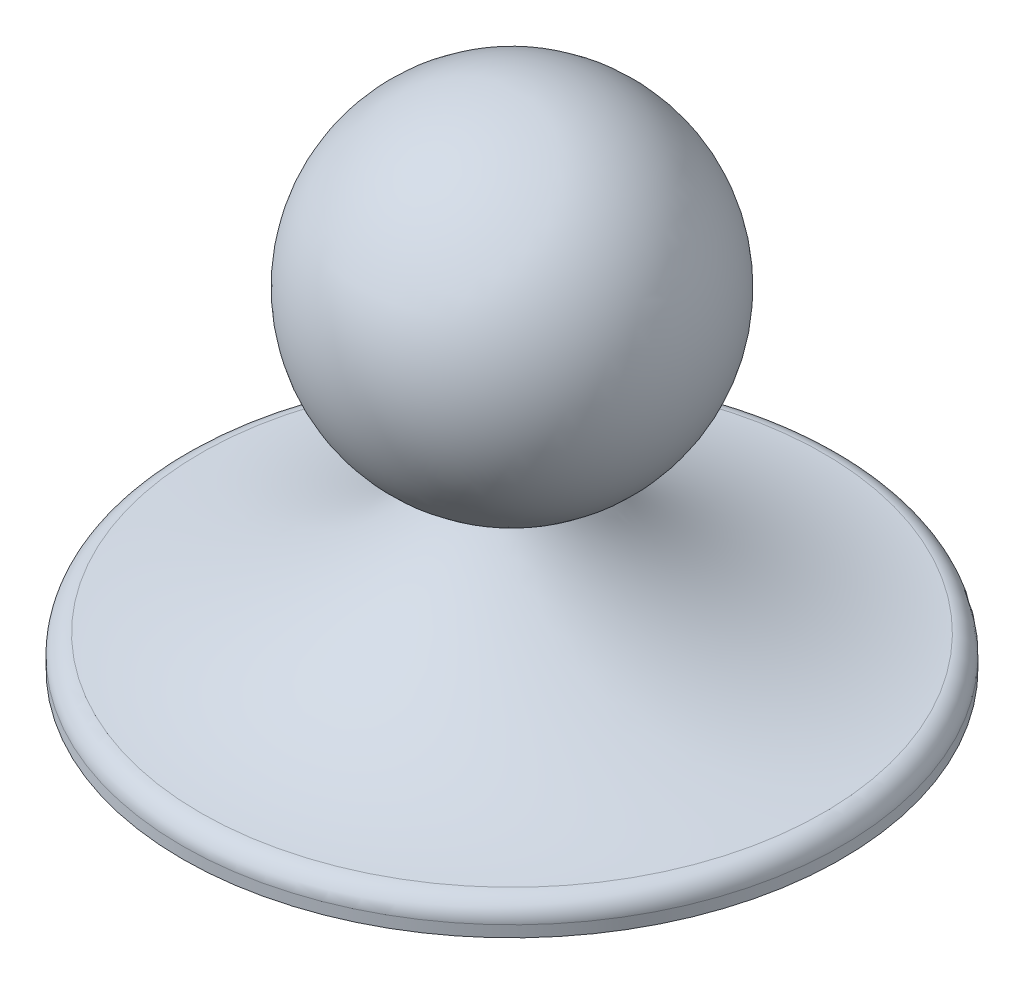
from build123d import *

# Parameters (mm, degrees)
VERRUNDUNG1_R = 1.5


with BuildPart() as part:
    # Skizze1 → Rotation1 (revolve)
    with BuildSketch(Plane.XY, mode=Mode.PRIVATE) as rotation1_sk:
        with BuildLine():
            ThreePointArc((4.042438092, 14.794366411), (12.763867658, 29.120071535), (0, 40))
            Line((0, 40), (0, 14.146046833))
            ThreePointArc((0, 14.146046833), (2.047048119, 14.309155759), (4.042438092, 14.794366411))
        make_face()
        with BuildLine():
            ThreePointArc((4.042438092, 14.794366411), (2.047048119, 14.309155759), (0, 14.146046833))
            Line((0, 14.146046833), (0, 0))
            Line((0, 0), (20, 0))
            Line((20, 0), (20, 2))
            Line((20, 2), (25, 2))
            Line((25, 2), (25, 4.274109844))
            add(Edge.make_bspline(
                [(25, 4.274109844), (16.001371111, 4.515011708), (6.998106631, 10.05236808), (4.042438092, 14.794366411)],
                knots=[0, 0, 0, 0, 1, 1, 1, 1], degree=3))
        make_face()
    revolve(rotation1_sk.sketch.rotate(Axis((0, 42.026456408, 0), (0, -1, 0)), 90), axis=Axis((0, 42.026456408, 0), (0, -1, 0)))

    # Verrundung1
    verrundung1_edges = [part.edges().sort_by_distance(p)[0] for p in [
        (0, 4.274109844, -25),
    ]]
    fillet(verrundung1_edges, radius=VERRUNDUNG1_R)


solid = part.part
